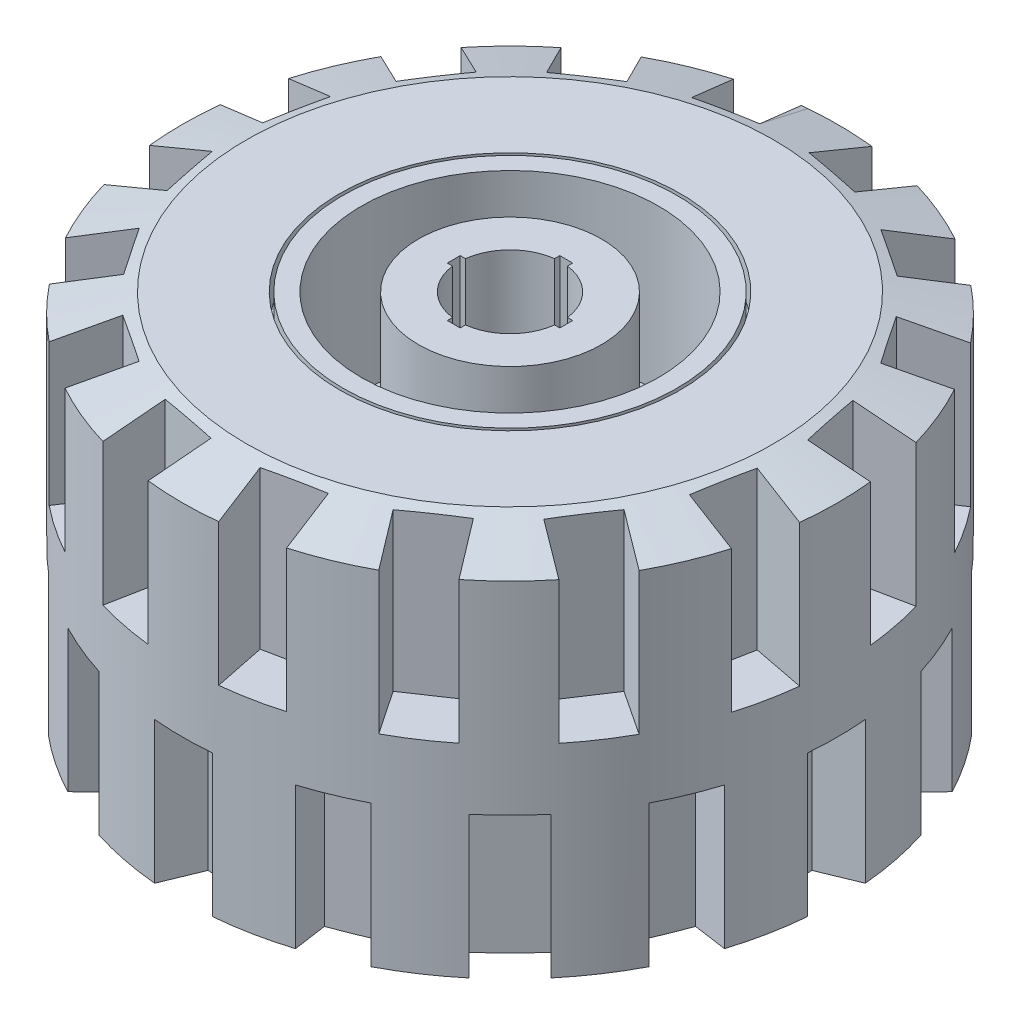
from build123d import *

# Parameters (mm, degrees)
ESBO_O1_W                = 10.2
ESBO_O1_H                = 11.9
CORTE_EXTRUS_O1_DEPTH    = 5
PADR_OCIRCULAR1_COUNT    = 16
CORTE_EXTRUS_O2_DEPTH    = 5
PADR_OCIRCULAR2_COUNT    = 16
ESBO_O6_R                = 5.5
ESBO_O6_R_2              = 5.4
CORTE_EXTRUS_O3_DEPTH    = 1
ESBO_O8_R                = 5.170010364
CORTE_EXTRUS_O4_DEPTH    = 3.6
CORTE_EXTRUS_O5_DEPTH    = 2
ESBO_O10_R               = 2.3
RESSALTO_EXTRUS_O1_DEPTH = 2
ESBO_O11_R               = 5.3
ESBO_O11_R_2             = 5.2
CORTE_EXTRUS_O6_DEPTH    = 1
ESBO_O12_R               = 4.625
ESBO_O12_R_2             = 2.85
CORTE_EXTRUS_O7_DEPTH    = 5


with BuildPart() as part:
    # Esbo_o1 → Revolu_o1 (revolve)
    with BuildSketch(Plane.XY, mode=Mode.PRIVATE) as revolu_o1_sk:
        with Locations((5.1, 5.95)):
            Rectangle(ESBO_O1_W, ESBO_O1_H)
    revolve(revolu_o1_sk.sketch.rotate(Axis((0, 0, 0), (0, 1, 0)), 90), axis=Axis((0, 0, 0), (0, 1, 0)))

    # Esbo_o3 → Corte-Revolu_o1 (revolve, cut)
    with BuildSketch(Plane.XY, mode=Mode.PRIVATE) as corte_revolu_o1_sk:
        Polygon((-8.2, 11.9), (-10.2, 11.313130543), (-10.2, 11.9), align=None)
        Polygon((-10.2, 0.586869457), (-10.2, 0), (-8.2, 0), align=None)
    revolve(corte_revolu_o1_sk.sketch.rotate(Axis((0, 13.154940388, 0), (0, -1, 0)), 270), axis=Axis((0, 13.154940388, 0), (0, -1, 0)), mode=Mode.SUBTRACT)

    # Esbo_o4 → Corte-extrus_o1 (cut)
    with BuildSketch(Plane.XZ):
        Polygon((0, 10.2), (-0.9, 10.2), (-0.9, 8.5), (0.9, 8.5), (0.9, 10.2), align=None)
    corte_extrus_o1 = extrude(amount=-CORTE_EXTRUS_O1_DEPTH, mode=Mode.SUBTRACT)

    # Padr_oCircular1: Corte-extrus_o1 ×16 about axis
    padr_ocircular1_axis = Axis((0, 0, 0), (0, 1, 0))
    for i in range(1, PADR_OCIRCULAR1_COUNT):
        add(corte_extrus_o1.rotate(padr_ocircular1_axis, i * 360 / PADR_OCIRCULAR1_COUNT), mode=Mode.SUBTRACT)

    # Esbo_o5 → Corte-extrus_o2 (cut)
    with BuildSketch(Plane(origin=(0, 11.9, 0), x_dir=(1, 0, 0), z_dir=(0, 1, 0))):
        Polygon((1.129672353, 10.170914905), (2.89676748, 9.828314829), (2.573200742, 8.159391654), (0.806105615, 8.501991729), align=None)
    corte_extrus_o2 = extrude(amount=-CORTE_EXTRUS_O2_DEPTH, mode=Mode.SUBTRACT)

    # Padr_oCircular2: Corte-extrus_o2 ×16 about axis
    padr_ocircular2_axis = Axis((0, 0, 0), (0, 1, 0))
    for i in range(1, PADR_OCIRCULAR2_COUNT):
        add(corte_extrus_o2.rotate(padr_ocircular2_axis, i * 360 / PADR_OCIRCULAR2_COUNT), mode=Mode.SUBTRACT)

    # Esbo_o6 → Corte-extrus_o3 (cut)
    with BuildSketch(Plane.XZ):
        with Locations(Location((0, 0, 0), (0, 0, 270))):
            Circle(ESBO_O6_R)
        with Locations(Location((0, 0, 0), (0, 0, 270))):
            Circle(ESBO_O6_R_2, mode=Mode.SUBTRACT)
    extrude(amount=-CORTE_EXTRUS_O3_DEPTH, mode=Mode.SUBTRACT)

    # Esbo_o8 → Corte-extrus_o4 (cut)
    with BuildSketch(Plane.XZ):
        with Locations(Location((0, 0, 0), (0, 0, 270))):
            Circle(ESBO_O8_R)
    extrude(amount=-CORTE_EXTRUS_O4_DEPTH, mode=Mode.SUBTRACT)

    # Esbo_o9 → Corte-extrus_o5 (cut)
    with BuildSketch(Plane.XZ.offset(-3.6)):
        with BuildLine():
            ThreePointArc((-0.3, 4.972177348), (-3.522254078, 3.522254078), (-4.972177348, 0.3))
            Line((-4.972177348, 0.3), (-0.3, 0.3))
            Line((-0.3, 0.3), (-0.3, 4.972177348))
        make_face()
        with BuildLine():
            ThreePointArc((-4.972177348, -0.3), (-3.522254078, -3.522254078), (-0.3, -4.972177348))
            Line((-0.3, -4.972177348), (-0.3, -0.3))
            Line((-0.3, -0.3), (-4.972177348, -0.3))
        make_face()
        with BuildLine():
            Line((4.972177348, -0.3), (0.3, -0.3))
            Line((0.3, -0.3), (0.3, -4.972177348))
            ThreePointArc((0.3, -4.972177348), (3.522254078, -3.522254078), (4.972177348, -0.3))
        make_face()
        with BuildLine():
            Line((0.3, 0.3), (4.972177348, 0.3))
            ThreePointArc((4.972177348, 0.3), (3.522254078, 3.522254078), (0.3, 4.972177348))
            Line((0.3, 4.972177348), (0.3, 0.3))
        make_face()
    extrude(amount=-CORTE_EXTRUS_O5_DEPTH, mode=Mode.SUBTRACT)

    # Esbo_o10 → Ressalto-extrus_o1 (add)
    with BuildSketch(Plane.XZ.offset(-5.6)):
        Circle(ESBO_O10_R)
    extrude(amount=RESSALTO_EXTRUS_O1_DEPTH)

    # Esbo_o11 → Corte-extrus_o6 (cut)
    with BuildSketch(Plane(origin=(0, 11.9, 0), x_dir=(1, 0, 0), z_dir=(0, 1, 0))):
        with Locations(Location((0, 0, 0), (0, 0, 270))):
            Circle(ESBO_O11_R)
        with Locations(Location((0, 0, 0), (0, 0, 270))):
            Circle(ESBO_O11_R_2, mode=Mode.SUBTRACT)
    extrude(amount=-CORTE_EXTRUS_O6_DEPTH, mode=Mode.SUBTRACT)

    # Esbo_o12 → Corte-extrus_o7 (cut)
    # profile 1 of 2: a face of its own
    with BuildSketch(Plane(origin=(0, 11.9, 0), x_dir=(1, 0, 0), z_dir=(0, 1, 0))):
        with Locations(Location((0, 0, 0), (0, 0, 270))):
            Circle(ESBO_O12_R)
        with Locations(Location((0, 0, 0), (0, 0, 270))):
            Circle(ESBO_O12_R_2, mode=Mode.SUBTRACT)
    # profile 2 of 2: a face of its own
    with BuildSketch(Plane(origin=(0, 11.9, 0), x_dir=(1, 0, 0), z_dir=(0, 1, 0))):
        with BuildLine():
            Line((0.2, -1.587450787), (0.2, -1.75))
            Line((0.2, -1.75), (-0.2, -1.75))
            Line((-0.2, -1.75), (-0.2, -1.587450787))
            ThreePointArc((-0.2, -1.587450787), (-1.13137085, -1.13137085), (-1.587450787, -0.2))
            Line((-1.587450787, -0.2), (-1.75, -0.2))
            Line((-1.75, -0.2), (-1.75, 0.2))
            Line((-1.75, 0.2), (-1.587450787, 0.2))
            ThreePointArc((-1.587450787, 0.2), (-1.13137085, 1.13137085), (-0.2, 1.587450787))
            Line((-0.2, 1.587450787), (-0.2, 1.75))
            Line((-0.2, 1.75), (0.2, 1.75))
            Line((0.2, 1.75), (0.2, 1.587450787))
            ThreePointArc((0.2, 1.587450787), (1.13137085, 1.13137085), (1.587450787, 0.2))
            Line((1.587450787, 0.2), (1.75, 0.2))
            Line((1.75, 0.2), (1.75, -0.2))
            Line((1.75, -0.2), (1.587450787, -0.2))
            ThreePointArc((1.587450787, -0.2), (1.13137085, -1.13137085), (0.2, -1.587450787))
        make_face()
    extrude(amount=-CORTE_EXTRUS_O7_DEPTH, mode=Mode.SUBTRACT)


solid = part.part
